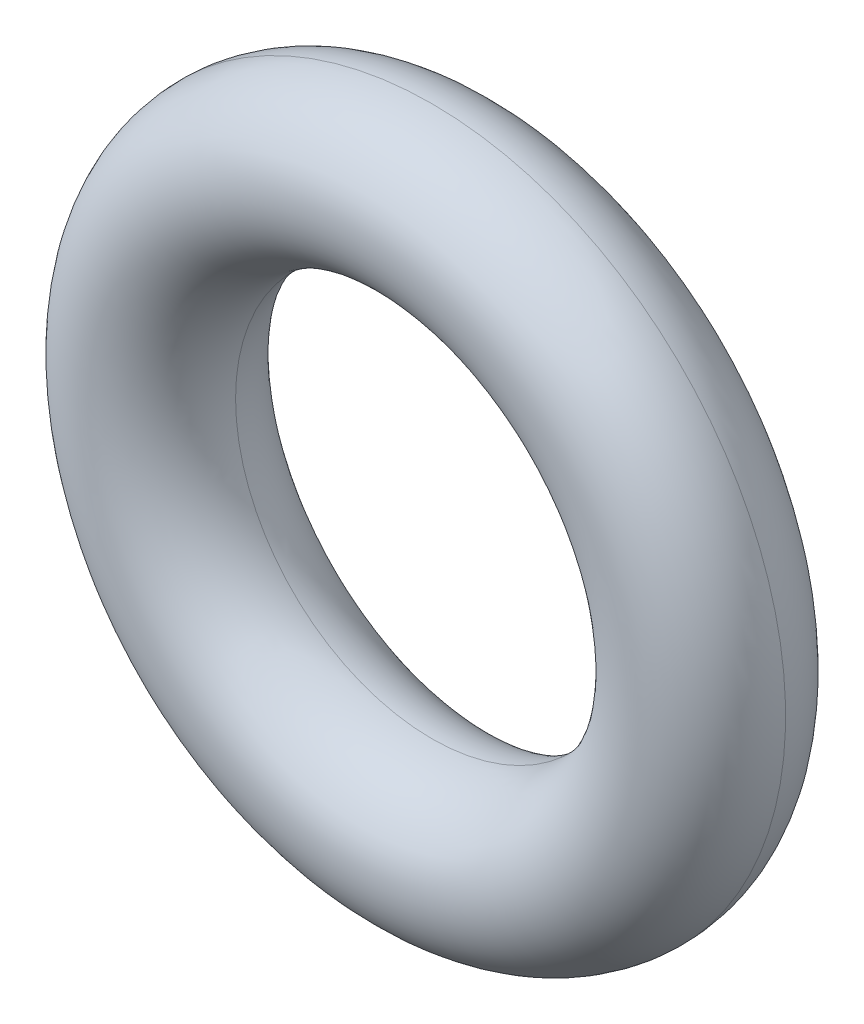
ISO-10303-21;
HEADER;
FILE_DESCRIPTION(('STEP AP214'),'2;1');
FILE_NAME('part.step','',(''),(''),'','','');
FILE_SCHEMA(('AUTOMOTIVE_DESIGN { 1 0 10303 214 1 1 1 1 }'));
ENDSEC;
DATA;
#1=APPLICATION_CONTEXT('core data for automotive mechanical design processes');
#2=APPLICATION_PROTOCOL_DEFINITION('international standard','automotive_design',2000,#1);
#3=PRODUCT_CONTEXT('',#1,'mechanical');
#4=PRODUCT('Part','Part','',(#3));
#5=PRODUCT_RELATED_PRODUCT_CATEGORY('part','',(#4));
#6=PRODUCT_DEFINITION_FORMATION('','',#4);
#7=PRODUCT_DEFINITION_CONTEXT('part definition',#1,'design');
#8=PRODUCT_DEFINITION('design','',#6,#7);
#9=PRODUCT_DEFINITION_SHAPE('','',#8);
#10=(LENGTH_UNIT() NAMED_UNIT(*) SI_UNIT(.MILLI.,.METRE.));
#11=(NAMED_UNIT(*) PLANE_ANGLE_UNIT() SI_UNIT($,.RADIAN.));
#12=(NAMED_UNIT(*) SI_UNIT($,.STERADIAN.) SOLID_ANGLE_UNIT());
#13=UNCERTAINTY_MEASURE_WITH_UNIT(LENGTH_MEASURE(1.E-05),#10,'distance_accuracy_value','');
#14=(GEOMETRIC_REPRESENTATION_CONTEXT(3) GLOBAL_UNCERTAINTY_ASSIGNED_CONTEXT((#13)) GLOBAL_UNIT_ASSIGNED_CONTEXT((#10,
#11,#12)) REPRESENTATION_CONTEXT('',''));
#15=CARTESIAN_POINT('',(0.,0.,0.));
#16=DIRECTION('',(0.,0.,1.));
#17=DIRECTION('',(1.,0.,0.));
#18=AXIS2_PLACEMENT_3D('',#15,#16,#17);
#19=CARTESIAN_POINT('',(0.,0.,1.778));
#20=DIRECTION('',(0.,0.,-1.));
#21=DIRECTION('',(0.,1.,0.));
#22=AXIS2_PLACEMENT_3D('',#19,#20,#21);
#23=TOROIDAL_SURFACE('',#22,6.223,1.778);
#24=CARTESIAN_POINT('',(0.,0.,1.778));
#25=DIRECTION('',(0.,0.,1.));
#26=DIRECTION('',(0.,-1.,0.));
#27=AXIS2_PLACEMENT_3D('',#24,#25,#26);
#28=CIRCLE('',#27,4.445);
#29=CARTESIAN_POINT('',(0.,-4.445,1.778));
#30=VERTEX_POINT('',#29);
#31=EDGE_CURVE('E18',#30,#30,#28,.F.);
#32=ORIENTED_EDGE('',*,*,#31,.T.);
#33=EDGE_LOOP('',(#32));
#34=FACE_BOUND('',#33,.T.);
#35=CARTESIAN_POINT('',(0.,0.,1.778));
#36=DIRECTION('',(0.,0.,-1.));
#37=DIRECTION('',(0.,1.,0.));
#38=AXIS2_PLACEMENT_3D('',#35,#36,#37);
#39=CIRCLE('',#38,8.001);
#40=CARTESIAN_POINT('',(0.,8.001,1.778));
#41=VERTEX_POINT('',#40);
#42=EDGE_CURVE('E8',#41,#41,#39,.F.);
#43=ORIENTED_EDGE('',*,*,#42,.T.);
#44=EDGE_LOOP('',(#43));
#45=FACE_BOUND('',#44,.T.);
#46=ADVANCED_FACE('F12',(#34,#45),#23,.T.);
#47=ORIENTED_EDGE('',*,*,#42,.F.);
#48=EDGE_LOOP('',(#47));
#49=FACE_BOUND('',#48,.T.);
#50=ORIENTED_EDGE('',*,*,#31,.F.);
#51=EDGE_LOOP('',(#50));
#52=FACE_BOUND('',#51,.T.);
#53=ADVANCED_FACE('F14',(#49,#52),#23,.T.);
#54=CLOSED_SHELL('',(#46,#53));
#55=MANIFOLD_SOLID_BREP('B1',#54);
#56=ADVANCED_BREP_SHAPE_REPRESENTATION('',(#18,#55),#14);
#57=SHAPE_DEFINITION_REPRESENTATION(#9,#56);
ENDSEC;
END-ISO-10303-21;
